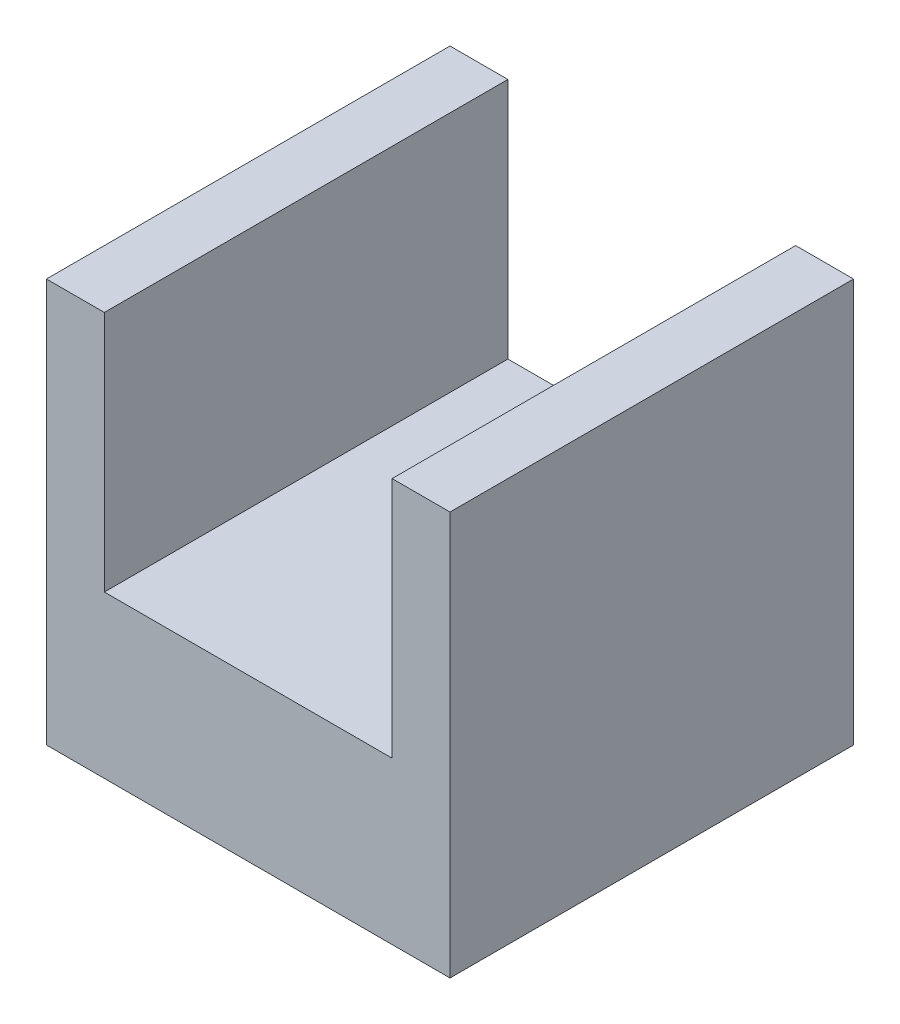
ISO-10303-21;
HEADER;
FILE_DESCRIPTION(('STEP AP214'),'2;1');
FILE_NAME('part.step','',(''),(''),'','','');
FILE_SCHEMA(('AUTOMOTIVE_DESIGN { 1 0 10303 214 1 1 1 1 }'));
ENDSEC;
DATA;
#1=APPLICATION_CONTEXT('core data for automotive mechanical design processes');
#2=APPLICATION_PROTOCOL_DEFINITION('international standard','automotive_design',2000,#1);
#3=PRODUCT_CONTEXT('',#1,'mechanical');
#4=PRODUCT('Part','Part','',(#3));
#5=PRODUCT_RELATED_PRODUCT_CATEGORY('part','',(#4));
#6=PRODUCT_DEFINITION_FORMATION('','',#4);
#7=PRODUCT_DEFINITION_CONTEXT('part definition',#1,'design');
#8=PRODUCT_DEFINITION('design','',#6,#7);
#9=PRODUCT_DEFINITION_SHAPE('','',#8);
#10=(LENGTH_UNIT() NAMED_UNIT(*) SI_UNIT(.MILLI.,.METRE.));
#11=(NAMED_UNIT(*) PLANE_ANGLE_UNIT() SI_UNIT($,.RADIAN.));
#12=(NAMED_UNIT(*) SI_UNIT($,.STERADIAN.) SOLID_ANGLE_UNIT());
#13=UNCERTAINTY_MEASURE_WITH_UNIT(LENGTH_MEASURE(1.E-05),#10,'distance_accuracy_value','');
#14=(GEOMETRIC_REPRESENTATION_CONTEXT(3) GLOBAL_UNCERTAINTY_ASSIGNED_CONTEXT((#13)) GLOBAL_UNIT_ASSIGNED_CONTEXT((#10,
#11,#12)) REPRESENTATION_CONTEXT('',''));
#15=CARTESIAN_POINT('',(0.,0.,0.));
#16=DIRECTION('',(0.,0.,1.));
#17=DIRECTION('',(1.,0.,0.));
#18=AXIS2_PLACEMENT_3D('',#15,#16,#17);
#19=CARTESIAN_POINT('',(-20.,20.,40.));
#20=DIRECTION('',(0.,1.,0.));
#21=DIRECTION('',(0.,0.,1.));
#22=AXIS2_PLACEMENT_3D('',#19,#20,#21);
#23=PLANE('',#22);
#24=DIRECTION('',(1.,0.,0.));
#25=VECTOR('',#24,1.);
#26=CARTESIAN_POINT('',(-20.,20.,40.));
#27=LINE('',#26,#25);
#28=CARTESIAN_POINT('',(-20.,20.,40.));
#29=VERTEX_POINT('',#28);
#30=CARTESIAN_POINT('',(-14.26,20.,40.));
#31=VERTEX_POINT('',#30);
#32=EDGE_CURVE('E132',#29,#31,#27,.T.);
#33=ORIENTED_EDGE('',*,*,#32,.T.);
#34=DIRECTION('',(0.,0.,-1.));
#35=VECTOR('',#34,1.);
#36=CARTESIAN_POINT('',(-14.26,20.,40.001));
#37=LINE('',#36,#35);
#38=CARTESIAN_POINT('',(-14.26,20.,0.));
#39=VERTEX_POINT('',#38);
#40=EDGE_CURVE('E116',#31,#39,#37,.T.);
#41=ORIENTED_EDGE('',*,*,#40,.T.);
#42=DIRECTION('',(1.,0.,0.));
#43=VECTOR('',#42,1.);
#44=CARTESIAN_POINT('',(-20.,20.,0.));
#45=LINE('',#44,#43);
#46=CARTESIAN_POINT('',(-20.,20.,0.));
#47=VERTEX_POINT('',#46);
#48=EDGE_CURVE('E152',#47,#39,#45,.T.);
#49=ORIENTED_EDGE('',*,*,#48,.F.);
#50=DIRECTION('',(0.,0.,-1.));
#51=VECTOR('',#50,1.);
#52=CARTESIAN_POINT('',(-20.,20.,40.));
#53=LINE('',#52,#51);
#54=EDGE_CURVE('E136',#29,#47,#53,.T.);
#55=ORIENTED_EDGE('',*,*,#54,.F.);
#56=EDGE_LOOP('',(#33,#41,#49,#55));
#57=FACE_BOUND('',#56,.T.);
#58=ADVANCED_FACE('F43',(#57),#23,.T.);
#59=CARTESIAN_POINT('',(14.26,20.,0.));
#60=VERTEX_POINT('',#59);
#61=CARTESIAN_POINT('',(20.,20.,0.));
#62=VERTEX_POINT('',#61);
#63=EDGE_CURVE('E151',#60,#62,#45,.T.);
#64=ORIENTED_EDGE('',*,*,#63,.F.);
#65=DIRECTION('',(0.,0.,-1.));
#66=VECTOR('',#65,1.);
#67=CARTESIAN_POINT('',(14.26,20.,40.001));
#68=LINE('',#67,#66);
#69=CARTESIAN_POINT('',(14.26,20.,40.));
#70=VERTEX_POINT('',#69);
#71=EDGE_CURVE('E58',#70,#60,#68,.T.);
#72=ORIENTED_EDGE('',*,*,#71,.F.);
#73=CARTESIAN_POINT('',(20.,20.,40.));
#74=VERTEX_POINT('',#73);
#75=EDGE_CURVE('E137',#70,#74,#27,.T.);
#76=ORIENTED_EDGE('',*,*,#75,.T.);
#77=DIRECTION('',(0.,0.,-1.));
#78=VECTOR('',#77,1.);
#79=CARTESIAN_POINT('',(20.,20.,40.));
#80=LINE('',#79,#78);
#81=EDGE_CURVE('E51',#74,#62,#80,.T.);
#82=ORIENTED_EDGE('',*,*,#81,.T.);
#83=EDGE_LOOP('',(#64,#72,#76,#82));
#84=FACE_BOUND('',#83,.T.);
#85=ADVANCED_FACE('F161',(#84),#23,.T.);
#86=CARTESIAN_POINT('',(0.,0.,40.));
#87=DIRECTION('',(0.,0.,-1.));
#88=DIRECTION('',(-1.,0.,0.));
#89=AXIS2_PLACEMENT_3D('',#86,#87,#88);
#90=PLANE('',#89);
#91=DIRECTION('',(0.,1.,0.));
#92=VECTOR('',#91,1.);
#93=CARTESIAN_POINT('',(-14.26,20.,40.));
#94=LINE('',#93,#92);
#95=CARTESIAN_POINT('',(-14.26,-4.,40.));
#96=VERTEX_POINT('',#95);
#97=EDGE_CURVE('E119',#96,#31,#94,.T.);
#98=ORIENTED_EDGE('',*,*,#97,.T.);
#99=ORIENTED_EDGE('',*,*,#32,.F.);
#100=DIRECTION('',(0.,-1.,0.));
#101=VECTOR('',#100,1.);
#102=CARTESIAN_POINT('',(-20.,20.,40.));
#103=LINE('',#102,#101);
#104=CARTESIAN_POINT('',(-20.,-20.,40.));
#105=VERTEX_POINT('',#104);
#106=EDGE_CURVE('E67',#29,#105,#103,.T.);
#107=ORIENTED_EDGE('',*,*,#106,.T.);
#108=DIRECTION('',(1.,0.,0.));
#109=VECTOR('',#108,1.);
#110=CARTESIAN_POINT('',(-20.,-20.,40.));
#111=LINE('',#110,#109);
#112=CARTESIAN_POINT('',(20.,-20.,40.));
#113=VERTEX_POINT('',#112);
#114=EDGE_CURVE('E92',#105,#113,#111,.T.);
#115=ORIENTED_EDGE('',*,*,#114,.T.);
#116=DIRECTION('',(0.,-1.,0.));
#117=VECTOR('',#116,1.);
#118=CARTESIAN_POINT('',(20.,20.,40.));
#119=LINE('',#118,#117);
#120=EDGE_CURVE('E141',#74,#113,#119,.T.);
#121=ORIENTED_EDGE('',*,*,#120,.F.);
#122=ORIENTED_EDGE('',*,*,#75,.F.);
#123=DIRECTION('',(0.,-1.,0.));
#124=VECTOR('',#123,1.);
#125=CARTESIAN_POINT('',(14.26,20.,40.));
#126=LINE('',#125,#124);
#127=CARTESIAN_POINT('',(14.26,-4.,40.));
#128=VERTEX_POINT('',#127);
#129=EDGE_CURVE('E127',#70,#128,#126,.T.);
#130=ORIENTED_EDGE('',*,*,#129,.T.);
#131=DIRECTION('',(-1.,0.,0.));
#132=VECTOR('',#131,1.);
#133=CARTESIAN_POINT('',(14.26,-4.,40.));
#134=LINE('',#133,#132);
#135=EDGE_CURVE('E134',#128,#96,#134,.T.);
#136=ORIENTED_EDGE('',*,*,#135,.T.);
#137=EDGE_LOOP('',(#98,#99,#107,#115,#121,#122,#130,#136));
#138=FACE_BOUND('',#137,.T.);
#139=ADVANCED_FACE('F131',(#138),#90,.F.);
#140=CARTESIAN_POINT('',(0.,0.,0.));
#141=DIRECTION('',(0.,0.,-1.));
#142=DIRECTION('',(-1.,0.,0.));
#143=AXIS2_PLACEMENT_3D('',#140,#141,#142);
#144=PLANE('',#143);
#145=ORIENTED_EDGE('',*,*,#48,.T.);
#146=DIRECTION('',(0.,-1.,0.));
#147=VECTOR('',#146,1.);
#148=CARTESIAN_POINT('',(-14.26,20.,0.));
#149=LINE('',#148,#147);
#150=CARTESIAN_POINT('',(-14.26,-4.,0.));
#151=VERTEX_POINT('',#150);
#152=EDGE_CURVE('E122',#39,#151,#149,.T.);
#153=ORIENTED_EDGE('',*,*,#152,.T.);
#154=DIRECTION('',(1.,0.,0.));
#155=VECTOR('',#154,1.);
#156=CARTESIAN_POINT('',(14.26,-4.,0.));
#157=LINE('',#156,#155);
#158=CARTESIAN_POINT('',(14.26,-4.,0.));
#159=VERTEX_POINT('',#158);
#160=EDGE_CURVE('E172',#151,#159,#157,.T.);
#161=ORIENTED_EDGE('',*,*,#160,.T.);
#162=DIRECTION('',(0.,1.,0.));
#163=VECTOR('',#162,1.);
#164=CARTESIAN_POINT('',(14.26,20.,0.));
#165=LINE('',#164,#163);
#166=EDGE_CURVE('E170',#159,#60,#165,.T.);
#167=ORIENTED_EDGE('',*,*,#166,.T.);
#168=ORIENTED_EDGE('',*,*,#63,.T.);
#169=DIRECTION('',(0.,-1.,0.));
#170=VECTOR('',#169,1.);
#171=CARTESIAN_POINT('',(20.,20.,0.));
#172=LINE('',#171,#170);
#173=CARTESIAN_POINT('',(20.,-20.,0.));
#174=VERTEX_POINT('',#173);
#175=EDGE_CURVE('E148',#62,#174,#172,.T.);
#176=ORIENTED_EDGE('',*,*,#175,.T.);
#177=DIRECTION('',(1.,0.,0.));
#178=VECTOR('',#177,1.);
#179=CARTESIAN_POINT('',(-20.,-20.,0.));
#180=LINE('',#179,#178);
#181=CARTESIAN_POINT('',(-20.,-20.,0.));
#182=VERTEX_POINT('',#181);
#183=EDGE_CURVE('E145',#182,#174,#180,.T.);
#184=ORIENTED_EDGE('',*,*,#183,.F.);
#185=DIRECTION('',(0.,-1.,0.));
#186=VECTOR('',#185,1.);
#187=CARTESIAN_POINT('',(-20.,20.,0.));
#188=LINE('',#187,#186);
#189=EDGE_CURVE('E87',#47,#182,#188,.T.);
#190=ORIENTED_EDGE('',*,*,#189,.F.);
#191=EDGE_LOOP('',(#145,#153,#161,#167,#168,#176,#184,#190));
#192=FACE_BOUND('',#191,.T.);
#193=ADVANCED_FACE('F168',(#192),#144,.T.);
#194=CARTESIAN_POINT('',(-20.,-20.,40.));
#195=DIRECTION('',(0.,1.,0.));
#196=DIRECTION('',(0.,0.,1.));
#197=AXIS2_PLACEMENT_3D('',#194,#195,#196);
#198=PLANE('',#197);
#199=ORIENTED_EDGE('',*,*,#183,.T.);
#200=DIRECTION('',(0.,0.,-1.));
#201=VECTOR('',#200,1.);
#202=CARTESIAN_POINT('',(20.,-20.,40.));
#203=LINE('',#202,#201);
#204=EDGE_CURVE('E11',#113,#174,#203,.T.);
#205=ORIENTED_EDGE('',*,*,#204,.F.);
#206=ORIENTED_EDGE('',*,*,#114,.F.);
#207=DIRECTION('',(0.,0.,-1.));
#208=VECTOR('',#207,1.);
#209=CARTESIAN_POINT('',(-20.,-20.,40.));
#210=LINE('',#209,#208);
#211=EDGE_CURVE('E139',#105,#182,#210,.T.);
#212=ORIENTED_EDGE('',*,*,#211,.T.);
#213=EDGE_LOOP('',(#199,#205,#206,#212));
#214=FACE_BOUND('',#213,.T.);
#215=ADVANCED_FACE('F45',(#214),#198,.F.);
#216=CARTESIAN_POINT('',(20.,20.,40.));
#217=DIRECTION('',(1.,0.,0.));
#218=DIRECTION('',(0.,1.,0.));
#219=AXIS2_PLACEMENT_3D('',#216,#217,#218);
#220=PLANE('',#219);
#221=ORIENTED_EDGE('',*,*,#175,.F.);
#222=ORIENTED_EDGE('',*,*,#81,.F.);
#223=ORIENTED_EDGE('',*,*,#120,.T.);
#224=ORIENTED_EDGE('',*,*,#204,.T.);
#225=EDGE_LOOP('',(#221,#222,#223,#224));
#226=FACE_BOUND('',#225,.T.);
#227=ADVANCED_FACE('F165',(#226),#220,.T.);
#228=CARTESIAN_POINT('',(-20.,20.,40.));
#229=DIRECTION('',(1.,0.,0.));
#230=DIRECTION('',(0.,1.,0.));
#231=AXIS2_PLACEMENT_3D('',#228,#229,#230);
#232=PLANE('',#231);
#233=ORIENTED_EDGE('',*,*,#189,.T.);
#234=ORIENTED_EDGE('',*,*,#211,.F.);
#235=ORIENTED_EDGE('',*,*,#106,.F.);
#236=ORIENTED_EDGE('',*,*,#54,.T.);
#237=EDGE_LOOP('',(#233,#234,#235,#236));
#238=FACE_BOUND('',#237,.T.);
#239=ADVANCED_FACE('F193',(#238),#232,.F.);
#240=CARTESIAN_POINT('',(-14.26,20.,40.001));
#241=DIRECTION('',(1.,0.,0.));
#242=DIRECTION('',(0.,1.,0.));
#243=AXIS2_PLACEMENT_3D('',#240,#241,#242);
#244=PLANE('',#243);
#245=DIRECTION('',(0.,0.,-1.));
#246=VECTOR('',#245,1.);
#247=CARTESIAN_POINT('',(-14.26,-4.,40.001));
#248=LINE('',#247,#246);
#249=EDGE_CURVE('E128',#96,#151,#248,.T.);
#250=ORIENTED_EDGE('',*,*,#249,.T.);
#251=ORIENTED_EDGE('',*,*,#152,.F.);
#252=ORIENTED_EDGE('',*,*,#40,.F.);
#253=ORIENTED_EDGE('',*,*,#97,.F.);
#254=EDGE_LOOP('',(#250,#251,#252,#253));
#255=FACE_BOUND('',#254,.T.);
#256=ADVANCED_FACE('F118',(#255),#244,.T.);
#257=CARTESIAN_POINT('',(14.26,-4.,40.001));
#258=DIRECTION('',(0.,1.,0.));
#259=DIRECTION('',(0.,0.,1.));
#260=AXIS2_PLACEMENT_3D('',#257,#258,#259);
#261=PLANE('',#260);
#262=DIRECTION('',(0.,0.,-1.));
#263=VECTOR('',#262,1.);
#264=CARTESIAN_POINT('',(14.26,-4.,40.001));
#265=LINE('',#264,#263);
#266=EDGE_CURVE('E175',#128,#159,#265,.T.);
#267=ORIENTED_EDGE('',*,*,#266,.T.);
#268=ORIENTED_EDGE('',*,*,#160,.F.);
#269=ORIENTED_EDGE('',*,*,#249,.F.);
#270=ORIENTED_EDGE('',*,*,#135,.F.);
#271=EDGE_LOOP('',(#267,#268,#269,#270));
#272=FACE_BOUND('',#271,.T.);
#273=ADVANCED_FACE('F184',(#272),#261,.T.);
#274=CARTESIAN_POINT('',(14.26,20.,40.001));
#275=DIRECTION('',(-1.,0.,0.));
#276=DIRECTION('',(0.,-1.,0.));
#277=AXIS2_PLACEMENT_3D('',#274,#275,#276);
#278=PLANE('',#277);
#279=ORIENTED_EDGE('',*,*,#71,.T.);
#280=ORIENTED_EDGE('',*,*,#166,.F.);
#281=ORIENTED_EDGE('',*,*,#266,.F.);
#282=ORIENTED_EDGE('',*,*,#129,.F.);
#283=EDGE_LOOP('',(#279,#280,#281,#282));
#284=FACE_BOUND('',#283,.T.);
#285=ADVANCED_FACE('F182',(#284),#278,.T.);
#286=CLOSED_SHELL('',(#58,#85,#139,#193,#215,#227,#239,#256,#273,#285));
#287=MANIFOLD_SOLID_BREP('B2',#286);
#288=ADVANCED_BREP_SHAPE_REPRESENTATION('',(#18,#287),#14);
#289=SHAPE_DEFINITION_REPRESENTATION(#9,#288);
ENDSEC;
END-ISO-10303-21;
